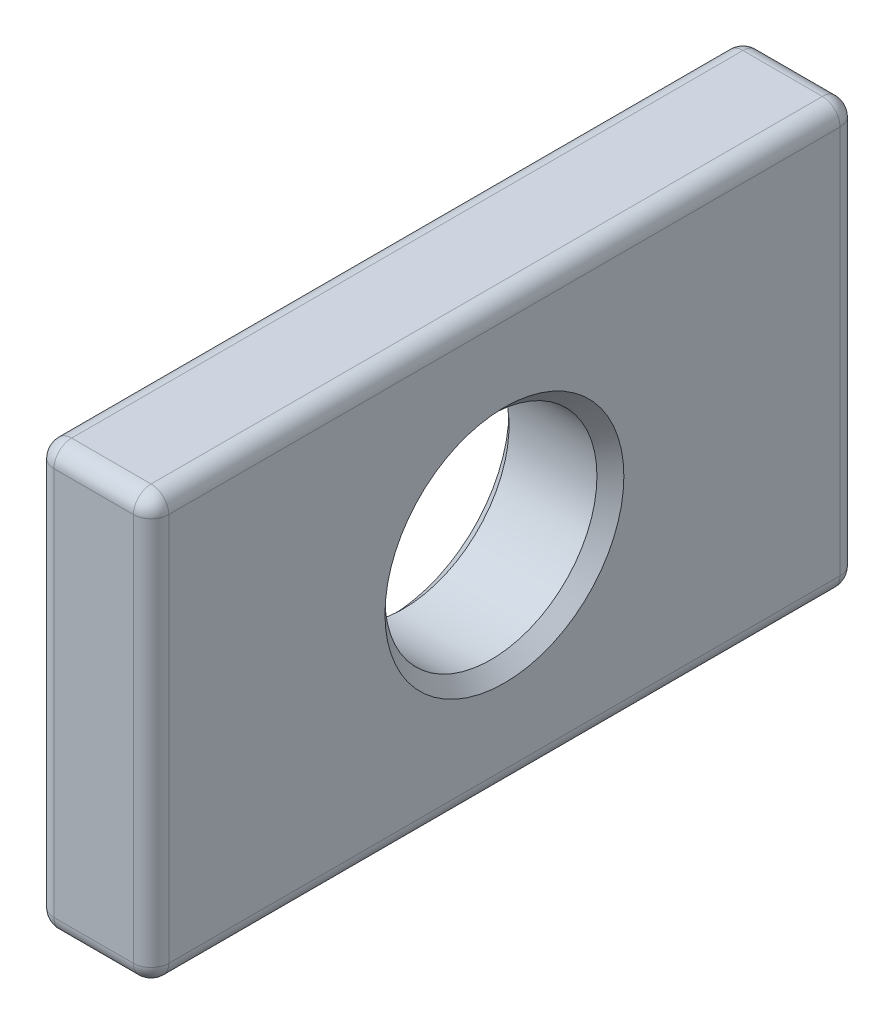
ISO-10303-21;
HEADER;
FILE_DESCRIPTION(('STEP AP214'),'2;1');
FILE_NAME('part.step','',(''),(''),'','','');
FILE_SCHEMA(('AUTOMOTIVE_DESIGN { 1 0 10303 214 1 1 1 1 }'));
ENDSEC;
DATA;
#1=APPLICATION_CONTEXT('core data for automotive mechanical design processes');
#2=APPLICATION_PROTOCOL_DEFINITION('international standard','automotive_design',2000,#1);
#3=PRODUCT_CONTEXT('',#1,'mechanical');
#4=PRODUCT('Part','Part','',(#3));
#5=PRODUCT_RELATED_PRODUCT_CATEGORY('part','',(#4));
#6=PRODUCT_DEFINITION_FORMATION('','',#4);
#7=PRODUCT_DEFINITION_CONTEXT('part definition',#1,'design');
#8=PRODUCT_DEFINITION('design','',#6,#7);
#9=PRODUCT_DEFINITION_SHAPE('','',#8);
#10=(LENGTH_UNIT() NAMED_UNIT(*) SI_UNIT(.MILLI.,.METRE.));
#11=(NAMED_UNIT(*) PLANE_ANGLE_UNIT() SI_UNIT($,.RADIAN.));
#12=(NAMED_UNIT(*) SI_UNIT($,.STERADIAN.) SOLID_ANGLE_UNIT());
#13=UNCERTAINTY_MEASURE_WITH_UNIT(LENGTH_MEASURE(1.E-05),#10,'distance_accuracy_value','');
#14=(GEOMETRIC_REPRESENTATION_CONTEXT(3) GLOBAL_UNCERTAINTY_ASSIGNED_CONTEXT((#13)) GLOBAL_UNIT_ASSIGNED_CONTEXT((#10,
#11,#12)) REPRESENTATION_CONTEXT('',''));
#15=CARTESIAN_POINT('',(0.,0.,0.));
#16=DIRECTION('',(0.,0.,1.));
#17=DIRECTION('',(1.,0.,0.));
#18=AXIS2_PLACEMENT_3D('',#15,#16,#17);
#19=CARTESIAN_POINT('',(3.25,0.,0.));
#20=DIRECTION('',(1.,0.,0.));
#21=DIRECTION('',(0.,0.,-1.));
#22=AXIS2_PLACEMENT_3D('',#19,#20,#21);
#23=PLANE('',#22);
#24=CARTESIAN_POINT('',(3.25,0.,0.));
#25=DIRECTION('',(1.,0.,0.));
#26=DIRECTION('',(0.,0.,-1.));
#27=AXIS2_PLACEMENT_3D('',#24,#25,#26);
#28=CIRCLE('',#27,6.76200000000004);
#29=CARTESIAN_POINT('',(3.25,0.,-6.76200000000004));
#30=VERTEX_POINT('',#29);
#31=EDGE_CURVE('E11',#30,#30,#28,.F.);
#32=ORIENTED_EDGE('',*,*,#31,.T.);
#33=EDGE_LOOP('',(#32));
#34=FACE_BOUND('',#33,.T.);
#35=DIRECTION('',(0.,0.,-1.));
#36=VECTOR('',#35,1.);
#37=CARTESIAN_POINT('',(3.25,-11.,-20.));
#38=LINE('',#37,#36);
#39=CARTESIAN_POINT('',(3.25,-11.,19.));
#40=VERTEX_POINT('',#39);
#41=CARTESIAN_POINT('',(3.25,-11.,-19.));
#42=VERTEX_POINT('',#41);
#43=EDGE_CURVE('E130',#40,#42,#38,.T.);
#44=ORIENTED_EDGE('',*,*,#43,.T.);
#45=DIRECTION('',(0.,1.,0.));
#46=VECTOR('',#45,1.);
#47=CARTESIAN_POINT('',(3.25,12.,-19.));
#48=LINE('',#47,#46);
#49=CARTESIAN_POINT('',(3.25,11.,-19.));
#50=VERTEX_POINT('',#49);
#51=EDGE_CURVE('E126',#42,#50,#48,.T.);
#52=ORIENTED_EDGE('',*,*,#51,.T.);
#53=DIRECTION('',(0.,0.,1.));
#54=VECTOR('',#53,1.);
#55=CARTESIAN_POINT('',(3.25,11.,20.));
#56=LINE('',#55,#54);
#57=CARTESIAN_POINT('',(3.25,11.,19.));
#58=VERTEX_POINT('',#57);
#59=EDGE_CURVE('E119',#50,#58,#56,.T.);
#60=ORIENTED_EDGE('',*,*,#59,.T.);
#61=DIRECTION('',(0.,-1.,0.));
#62=VECTOR('',#61,1.);
#63=CARTESIAN_POINT('',(3.25,-12.,19.));
#64=LINE('',#63,#62);
#65=EDGE_CURVE('E123',#58,#40,#64,.T.);
#66=ORIENTED_EDGE('',*,*,#65,.T.);
#67=EDGE_LOOP('',(#44,#52,#60,#66));
#68=FACE_BOUND('',#67,.T.);
#69=ADVANCED_FACE('F32',(#34,#68),#23,.T.);
#70=CARTESIAN_POINT('',(-3.25,0.,0.));
#71=DIRECTION('',(1.,0.,0.));
#72=DIRECTION('',(0.,0.,-1.));
#73=AXIS2_PLACEMENT_3D('',#70,#71,#72);
#74=PLANE('',#73);
#75=CARTESIAN_POINT('',(-3.25,0.,0.));
#76=DIRECTION('',(1.,0.,0.));
#77=DIRECTION('',(0.,0.,-1.));
#78=AXIS2_PLACEMENT_3D('',#75,#76,#77);
#79=CIRCLE('',#78,6.76199999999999);
#80=CARTESIAN_POINT('',(-3.25,0.,-6.76199999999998));
#81=VERTEX_POINT('',#80);
#82=EDGE_CURVE('E204',#81,#81,#79,.T.);
#83=ORIENTED_EDGE('',*,*,#82,.T.);
#84=EDGE_LOOP('',(#83));
#85=FACE_BOUND('',#84,.T.);
#86=DIRECTION('',(0.,0.,1.));
#87=VECTOR('',#86,1.);
#88=CARTESIAN_POINT('',(-3.25,11.,0.));
#89=LINE('',#88,#87);
#90=CARTESIAN_POINT('',(-3.25,11.,19.));
#91=VERTEX_POINT('',#90);
#92=CARTESIAN_POINT('',(-3.25,11.,-19.));
#93=VERTEX_POINT('',#92);
#94=EDGE_CURVE('E175',#91,#93,#89,.F.);
#95=ORIENTED_EDGE('',*,*,#94,.T.);
#96=DIRECTION('',(0.,1.,0.));
#97=VECTOR('',#96,1.);
#98=CARTESIAN_POINT('',(-3.25,0.,-19.));
#99=LINE('',#98,#97);
#100=CARTESIAN_POINT('',(-3.25,-11.,-19.));
#101=VERTEX_POINT('',#100);
#102=EDGE_CURVE('E180',#93,#101,#99,.F.);
#103=ORIENTED_EDGE('',*,*,#102,.T.);
#104=DIRECTION('',(0.,0.,-1.));
#105=VECTOR('',#104,1.);
#106=CARTESIAN_POINT('',(-3.25,-11.,0.));
#107=LINE('',#106,#105);
#108=CARTESIAN_POINT('',(-3.25,-11.,19.));
#109=VERTEX_POINT('',#108);
#110=EDGE_CURVE('E177',#101,#109,#107,.F.);
#111=ORIENTED_EDGE('',*,*,#110,.T.);
#112=DIRECTION('',(0.,-1.,0.));
#113=VECTOR('',#112,1.);
#114=CARTESIAN_POINT('',(-3.25,0.,19.));
#115=LINE('',#114,#113);
#116=EDGE_CURVE('E173',#109,#91,#115,.F.);
#117=ORIENTED_EDGE('',*,*,#116,.T.);
#118=EDGE_LOOP('',(#95,#103,#111,#117));
#119=FACE_BOUND('',#118,.T.);
#120=ADVANCED_FACE('F270',(#85,#119),#74,.F.);
#121=CARTESIAN_POINT('',(3.25,12.,-20.));
#122=DIRECTION('',(0.,0.,1.));
#123=DIRECTION('',(1.,0.,0.));
#124=AXIS2_PLACEMENT_3D('',#121,#122,#123);
#125=PLANE('',#124);
#126=DIRECTION('',(0.,1.,0.));
#127=VECTOR('',#126,1.);
#128=CARTESIAN_POINT('',(2.25,-12.,-20.));
#129=LINE('',#128,#127);
#130=CARTESIAN_POINT('',(2.25,11.,-20.));
#131=VERTEX_POINT('',#130);
#132=CARTESIAN_POINT('',(2.25,-11.,-20.));
#133=VERTEX_POINT('',#132);
#134=EDGE_CURVE('E193',#131,#133,#129,.F.);
#135=ORIENTED_EDGE('',*,*,#134,.T.);
#136=DIRECTION('',(-1.,0.,0.));
#137=VECTOR('',#136,1.);
#138=CARTESIAN_POINT('',(3.25,-11.,-20.));
#139=LINE('',#138,#137);
#140=CARTESIAN_POINT('',(-2.25,-11.,-20.));
#141=VERTEX_POINT('',#140);
#142=EDGE_CURVE('E195',#133,#141,#139,.T.);
#143=ORIENTED_EDGE('',*,*,#142,.T.);
#144=DIRECTION('',(0.,1.,0.));
#145=VECTOR('',#144,1.);
#146=CARTESIAN_POINT('',(-2.25,12.,-20.));
#147=LINE('',#146,#145);
#148=CARTESIAN_POINT('',(-2.25,11.,-20.));
#149=VERTEX_POINT('',#148);
#150=EDGE_CURVE('E189',#141,#149,#147,.T.);
#151=ORIENTED_EDGE('',*,*,#150,.T.);
#152=DIRECTION('',(-1.,0.,0.));
#153=VECTOR('',#152,1.);
#154=CARTESIAN_POINT('',(3.25,11.,-20.));
#155=LINE('',#154,#153);
#156=EDGE_CURVE('E191',#149,#131,#155,.F.);
#157=ORIENTED_EDGE('',*,*,#156,.T.);
#158=EDGE_LOOP('',(#135,#143,#151,#157));
#159=FACE_BOUND('',#158,.T.);
#160=ADVANCED_FACE('F273',(#159),#125,.F.);
#161=CARTESIAN_POINT('',(3.25,12.,20.));
#162=DIRECTION('',(0.,-1.,0.));
#163=DIRECTION('',(0.,0.,-1.));
#164=AXIS2_PLACEMENT_3D('',#161,#162,#163);
#165=PLANE('',#164);
#166=DIRECTION('',(0.,0.,1.));
#167=VECTOR('',#166,1.);
#168=CARTESIAN_POINT('',(2.25,12.,-20.));
#169=LINE('',#168,#167);
#170=CARTESIAN_POINT('',(2.25,12.,19.));
#171=VERTEX_POINT('',#170);
#172=CARTESIAN_POINT('',(2.25,12.,-19.));
#173=VERTEX_POINT('',#172);
#174=EDGE_CURVE('E138',#171,#173,#169,.F.);
#175=ORIENTED_EDGE('',*,*,#174,.T.);
#176=DIRECTION('',(-1.,0.,0.));
#177=VECTOR('',#176,1.);
#178=CARTESIAN_POINT('',(3.25,12.,-19.));
#179=LINE('',#178,#177);
#180=CARTESIAN_POINT('',(-2.25,12.,-19.));
#181=VERTEX_POINT('',#180);
#182=EDGE_CURVE('E187',#173,#181,#179,.T.);
#183=ORIENTED_EDGE('',*,*,#182,.T.);
#184=DIRECTION('',(0.,0.,1.));
#185=VECTOR('',#184,1.);
#186=CARTESIAN_POINT('',(-2.25,12.,20.));
#187=LINE('',#186,#185);
#188=CARTESIAN_POINT('',(-2.25,12.,19.));
#189=VERTEX_POINT('',#188);
#190=EDGE_CURVE('E184',#181,#189,#187,.T.);
#191=ORIENTED_EDGE('',*,*,#190,.T.);
#192=DIRECTION('',(-1.,0.,0.));
#193=VECTOR('',#192,1.);
#194=CARTESIAN_POINT('',(3.25,12.,19.));
#195=LINE('',#194,#193);
#196=EDGE_CURVE('E182',#189,#171,#195,.F.);
#197=ORIENTED_EDGE('',*,*,#196,.T.);
#198=EDGE_LOOP('',(#175,#183,#191,#197));
#199=FACE_BOUND('',#198,.T.);
#200=ADVANCED_FACE('F317',(#199),#165,.F.);
#201=CARTESIAN_POINT('',(3.25,12.,20.));
#202=DIRECTION('',(0.,0.,-1.));
#203=DIRECTION('',(-1.,0.,0.));
#204=AXIS2_PLACEMENT_3D('',#201,#202,#203);
#205=PLANE('',#204);
#206=DIRECTION('',(0.,-1.,0.));
#207=VECTOR('',#206,1.);
#208=CARTESIAN_POINT('',(2.25,12.,20.));
#209=LINE('',#208,#207);
#210=CARTESIAN_POINT('',(2.25,-11.,20.));
#211=VERTEX_POINT('',#210);
#212=CARTESIAN_POINT('',(2.25,11.,20.));
#213=VERTEX_POINT('',#212);
#214=EDGE_CURVE('E47',#211,#213,#209,.F.);
#215=ORIENTED_EDGE('',*,*,#214,.T.);
#216=DIRECTION('',(-1.,0.,0.));
#217=VECTOR('',#216,1.);
#218=CARTESIAN_POINT('',(3.25,11.,20.));
#219=LINE('',#218,#217);
#220=CARTESIAN_POINT('',(-2.25,11.,20.));
#221=VERTEX_POINT('',#220);
#222=EDGE_CURVE('E202',#213,#221,#219,.T.);
#223=ORIENTED_EDGE('',*,*,#222,.T.);
#224=DIRECTION('',(0.,-1.,0.));
#225=VECTOR('',#224,1.);
#226=CARTESIAN_POINT('',(-2.25,12.,20.));
#227=LINE('',#226,#225);
#228=CARTESIAN_POINT('',(-2.25,-11.,20.));
#229=VERTEX_POINT('',#228);
#230=EDGE_CURVE('E198',#221,#229,#227,.T.);
#231=ORIENTED_EDGE('',*,*,#230,.T.);
#232=DIRECTION('',(-1.,0.,0.));
#233=VECTOR('',#232,1.);
#234=CARTESIAN_POINT('',(3.25,-11.,20.));
#235=LINE('',#234,#233);
#236=EDGE_CURVE('E52',#229,#211,#235,.F.);
#237=ORIENTED_EDGE('',*,*,#236,.T.);
#238=EDGE_LOOP('',(#215,#223,#231,#237));
#239=FACE_BOUND('',#238,.T.);
#240=ADVANCED_FACE('F314',(#239),#205,.F.);
#241=CARTESIAN_POINT('',(3.25,-12.,20.));
#242=DIRECTION('',(0.,1.,0.));
#243=DIRECTION('',(0.,0.,1.));
#244=AXIS2_PLACEMENT_3D('',#241,#242,#243);
#245=PLANE('',#244);
#246=DIRECTION('',(0.,0.,-1.));
#247=VECTOR('',#246,1.);
#248=CARTESIAN_POINT('',(-2.25,-12.,20.));
#249=LINE('',#248,#247);
#250=CARTESIAN_POINT('',(-2.25,-12.,19.));
#251=VERTEX_POINT('',#250);
#252=CARTESIAN_POINT('',(-2.25,-12.,-19.));
#253=VERTEX_POINT('',#252);
#254=EDGE_CURVE('E166',#251,#253,#249,.T.);
#255=ORIENTED_EDGE('',*,*,#254,.T.);
#256=DIRECTION('',(-1.,0.,0.));
#257=VECTOR('',#256,1.);
#258=CARTESIAN_POINT('',(3.25,-12.,-19.));
#259=LINE('',#258,#257);
#260=CARTESIAN_POINT('',(2.25,-12.,-19.));
#261=VERTEX_POINT('',#260);
#262=EDGE_CURVE('E171',#253,#261,#259,.F.);
#263=ORIENTED_EDGE('',*,*,#262,.T.);
#264=DIRECTION('',(0.,0.,-1.));
#265=VECTOR('',#264,1.);
#266=CARTESIAN_POINT('',(2.25,-12.,20.));
#267=LINE('',#266,#265);
#268=CARTESIAN_POINT('',(2.25,-12.,19.));
#269=VERTEX_POINT('',#268);
#270=EDGE_CURVE('E168',#261,#269,#267,.F.);
#271=ORIENTED_EDGE('',*,*,#270,.T.);
#272=DIRECTION('',(-1.,0.,0.));
#273=VECTOR('',#272,1.);
#274=CARTESIAN_POINT('',(3.25,-12.,19.));
#275=LINE('',#274,#273);
#276=EDGE_CURVE('E164',#269,#251,#275,.T.);
#277=ORIENTED_EDGE('',*,*,#276,.T.);
#278=EDGE_LOOP('',(#255,#263,#271,#277));
#279=FACE_BOUND('',#278,.T.);
#280=ADVANCED_FACE('F316',(#279),#245,.F.);
#281=CARTESIAN_POINT('',(3.25,0.,0.));
#282=DIRECTION('',(-1.,0.,0.));
#283=DIRECTION('',(0.,0.,1.));
#284=AXIS2_PLACEMENT_3D('',#281,#282,#283);
#285=CYLINDRICAL_SURFACE('',#284,6.);
#286=CARTESIAN_POINT('',(-2.48800000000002,0.,0.));
#287=DIRECTION('',(1.,0.,0.));
#288=DIRECTION('',(0.,0.,-1.));
#289=AXIS2_PLACEMENT_3D('',#286,#287,#288);
#290=CIRCLE('',#289,6.);
#291=CARTESIAN_POINT('',(-2.48800000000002,0.,6.00000000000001));
#292=VERTEX_POINT('',#291);
#293=EDGE_CURVE('E40',#292,#292,#290,.F.);
#294=CARTESIAN_POINT('',(2.48799999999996,0.,0.));
#295=DIRECTION('',(1.,0.,0.));
#296=DIRECTION('',(0.,0.,-1.));
#297=AXIS2_PLACEMENT_3D('',#294,#295,#296);
#298=CIRCLE('',#297,6.);
#299=CARTESIAN_POINT('',(2.48799999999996,0.,6.00000000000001));
#300=VERTEX_POINT('',#299);
#301=EDGE_CURVE('E256',#300,#300,#298,.T.);
#302=CARTESIAN_POINT('',(-2.48800000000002,0.,6.00000000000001));
#303=CARTESIAN_POINT('',(-2.43616666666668,0.,6.00000000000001));
#304=CARTESIAN_POINT('',(-2.38433333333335,0.,6.00000000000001));
#305=CARTESIAN_POINT('',(-2.28066666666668,0.,6.00000000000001));
#306=CARTESIAN_POINT('',(-2.22883333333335,0.,6.00000000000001));
#307=CARTESIAN_POINT('',(-2.12516666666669,0.,6.00000000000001));
#308=CARTESIAN_POINT('',(-2.07333333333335,0.,6.00000000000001));
#309=CARTESIAN_POINT('',(-1.96966666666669,0.,6.00000000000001));
#310=CARTESIAN_POINT('',(-1.91783333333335,0.,6.00000000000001));
#311=CARTESIAN_POINT('',(-1.81416666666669,0.,6.00000000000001));
#312=CARTESIAN_POINT('',(-1.76233333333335,0.,6.00000000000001));
#313=CARTESIAN_POINT('',(-1.65866666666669,0.,6.00000000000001));
#314=CARTESIAN_POINT('',(-1.60683333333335,0.,6.00000000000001));
#315=CARTESIAN_POINT('',(-1.50316666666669,0.,6.00000000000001));
#316=CARTESIAN_POINT('',(-1.45133333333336,0.,6.00000000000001));
#317=CARTESIAN_POINT('',(-1.34766666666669,0.,6.00000000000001));
#318=CARTESIAN_POINT('',(-1.29583333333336,0.,6.00000000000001));
#319=CARTESIAN_POINT('',(-1.19216666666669,0.,6.00000000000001));
#320=CARTESIAN_POINT('',(-1.14033333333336,0.,6.00000000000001));
#321=CARTESIAN_POINT('',(-1.03666666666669,0.,6.00000000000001));
#322=CARTESIAN_POINT('',(-0.984833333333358,0.,6.00000000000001));
#323=CARTESIAN_POINT('',(-0.881166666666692,0.,6.00000000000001));
#324=CARTESIAN_POINT('',(-0.829333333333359,0.,6.00000000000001));
#325=CARTESIAN_POINT('',(-0.725666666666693,0.,6.00000000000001));
#326=CARTESIAN_POINT('',(-0.67383333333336,0.,6.00000000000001));
#327=CARTESIAN_POINT('',(-0.570166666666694,0.,6.00000000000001));
#328=CARTESIAN_POINT('',(-0.518333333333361,0.,6.00000000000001));
#329=CARTESIAN_POINT('',(-0.414666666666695,0.,6.00000000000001));
#330=CARTESIAN_POINT('',(-0.362833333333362,0.,6.00000000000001));
#331=CARTESIAN_POINT('',(-0.259166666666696,0.,6.00000000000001));
#332=CARTESIAN_POINT('',(-0.207333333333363,0.,6.00000000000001));
#333=CARTESIAN_POINT('',(-0.103666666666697,0.,6.00000000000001));
#334=CARTESIAN_POINT('',(-0.0518333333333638,0.,6.00000000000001));
#335=CARTESIAN_POINT('',(0.0518333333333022,0.,6.00000000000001));
#336=CARTESIAN_POINT('',(0.103666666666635,0.,6.00000000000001));
#337=CARTESIAN_POINT('',(0.207333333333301,0.,6.00000000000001));
#338=CARTESIAN_POINT('',(0.259166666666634,0.,6.00000000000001));
#339=CARTESIAN_POINT('',(0.362833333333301,0.,6.00000000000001));
#340=CARTESIAN_POINT('',(0.414666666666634,0.,6.00000000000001));
#341=CARTESIAN_POINT('',(0.5183333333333,0.,6.00000000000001));
#342=CARTESIAN_POINT('',(0.570166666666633,0.,6.00000000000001));
#343=CARTESIAN_POINT('',(0.673833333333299,0.,6.00000000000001));
#344=CARTESIAN_POINT('',(0.725666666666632,0.,6.00000000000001));
#345=CARTESIAN_POINT('',(0.829333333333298,0.,6.00000000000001));
#346=CARTESIAN_POINT('',(0.881166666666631,0.,6.00000000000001));
#347=CARTESIAN_POINT('',(0.984833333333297,0.,6.00000000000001));
#348=CARTESIAN_POINT('',(1.03666666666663,0.,6.00000000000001));
#349=CARTESIAN_POINT('',(1.1403333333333,0.,6.00000000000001));
#350=CARTESIAN_POINT('',(1.19216666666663,0.,6.00000000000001));
#351=CARTESIAN_POINT('',(1.2958333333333,0.,6.00000000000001));
#352=CARTESIAN_POINT('',(1.34766666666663,0.,6.00000000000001));
#353=CARTESIAN_POINT('',(1.45133333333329,0.,6.00000000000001));
#354=CARTESIAN_POINT('',(1.50316666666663,0.,6.00000000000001));
#355=CARTESIAN_POINT('',(1.60683333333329,0.,6.00000000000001));
#356=CARTESIAN_POINT('',(1.65866666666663,0.,6.00000000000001));
#357=CARTESIAN_POINT('',(1.76233333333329,0.,6.00000000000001));
#358=CARTESIAN_POINT('',(1.81416666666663,0.,6.00000000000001));
#359=CARTESIAN_POINT('',(1.91783333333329,0.,6.00000000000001));
#360=CARTESIAN_POINT('',(1.96966666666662,0.,6.00000000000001));
#361=CARTESIAN_POINT('',(2.07333333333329,0.,6.00000000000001));
#362=CARTESIAN_POINT('',(2.12516666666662,0.,6.00000000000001));
#363=CARTESIAN_POINT('',(2.22883333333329,0.,6.00000000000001));
#364=CARTESIAN_POINT('',(2.28066666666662,0.,6.00000000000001));
#365=CARTESIAN_POINT('',(2.38433333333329,0.,6.00000000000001));
#366=CARTESIAN_POINT('',(2.43616666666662,0.,6.00000000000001));
#367=CARTESIAN_POINT('',(2.48799999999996,0.,6.00000000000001));
#368=B_SPLINE_CURVE_WITH_KNOTS('',3,(#302,#303,#304,#305,#306,#307,#308,#309,#310,#311,#312,
#313,#314,#315,#316,#317,#318,#319,#320,#321,#322,#323,#324,#325,#326,#327,#328,#329,#330,#331,
#332,#333,#334,#335,#336,#337,#338,#339,#340,#341,#342,#343,#344,#345,#346,#347,#348,#349,#350,
#351,#352,#353,#354,#355,#356,#357,#358,#359,#360,#361,#362,#363,#364,#365,#366,#367),
.UNSPECIFIED.,.F.,.F.,(4,2,2,2,2,2,2,2,2,2,2,2,2,2,2,2,2,2,2,2,2,2,2,2,2,2,2,2,2,2,2,2,4),(0.,
0.155499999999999,0.310999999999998,0.466499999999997,0.621999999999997,0.777499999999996,
0.932999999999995,1.08849999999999,1.24399999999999,1.39949999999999,1.55499999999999,
1.71049999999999,1.86599999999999,2.02149999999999,2.17699999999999,2.33249999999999,
2.48799999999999,2.64349999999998,2.79899999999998,2.95449999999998,3.10999999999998,
3.26549999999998,3.42099999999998,3.57649999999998,3.73199999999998,3.88749999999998,
4.04299999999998,4.19849999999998,4.35399999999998,4.50949999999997,4.66499999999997,
4.82049999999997,4.97599999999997),.UNSPECIFIED.);
#369=EDGE_CURVE('BSEAM261',#292,#300,#368,.T.);
#370=ORIENTED_EDGE('',*,*,#293,.T.);
#371=ORIENTED_EDGE('',*,*,#301,.T.);
#372=ORIENTED_EDGE('',*,*,#369,.T.);
#373=ORIENTED_EDGE('',*,*,#369,.F.);
#374=EDGE_LOOP('',(#370,#372,#371,#373));
#375=FACE_BOUND('',#374,.T.);
#376=ADVANCED_FACE('F261',(#375),#285,.F.);
#377=CARTESIAN_POINT('',(-2.25,11.,20.));
#378=DIRECTION('',(0.,0.,1.));
#379=DIRECTION('',(1.,0.,0.));
#380=AXIS2_PLACEMENT_3D('',#377,#378,#379);
#381=CYLINDRICAL_SURFACE('',#380,1.);
#382=CARTESIAN_POINT('',(-2.25,11.,19.));
#383=DIRECTION('',(0.,0.,1.));
#384=DIRECTION('',(1.,0.,0.));
#385=AXIS2_PLACEMENT_3D('',#382,#383,#384);
#386=CIRCLE('',#385,1.);
#387=EDGE_CURVE('E156',#189,#91,#386,.T.);
#388=ORIENTED_EDGE('',*,*,#387,.F.);
#389=ORIENTED_EDGE('',*,*,#190,.F.);
#390=CARTESIAN_POINT('',(-2.25,11.,-19.));
#391=DIRECTION('',(0.,0.,-1.));
#392=DIRECTION('',(0.,1.,0.));
#393=AXIS2_PLACEMENT_3D('',#390,#391,#392);
#394=CIRCLE('',#393,1.);
#395=EDGE_CURVE('E159',#93,#181,#394,.T.);
#396=ORIENTED_EDGE('',*,*,#395,.F.);
#397=ORIENTED_EDGE('',*,*,#94,.F.);
#398=EDGE_LOOP('',(#388,#389,#396,#397));
#399=FACE_BOUND('',#398,.T.);
#400=ADVANCED_FACE('F284',(#399),#381,.T.);
#401=CARTESIAN_POINT('',(-2.25,11.,19.));
#402=DIRECTION('',(0.,0.,1.));
#403=DIRECTION('',(1.,0.,0.));
#404=AXIS2_PLACEMENT_3D('',#401,#402,#403);
#405=SPHERICAL_SURFACE('',#404,1.);
#406=CARTESIAN_POINT('',(-2.25,11.,19.));
#407=DIRECTION('',(-1.,0.,0.));
#408=DIRECTION('',(0.,0.,1.));
#409=AXIS2_PLACEMENT_3D('',#406,#407,#408);
#410=CIRCLE('',#409,1.);
#411=EDGE_CURVE('E246',#189,#221,#410,.F.);
#412=ORIENTED_EDGE('',*,*,#411,.F.);
#413=ORIENTED_EDGE('',*,*,#387,.T.);
#414=CARTESIAN_POINT('',(-2.25,11.,19.));
#415=DIRECTION('',(0.,1.,0.));
#416=DIRECTION('',(0.,0.,1.));
#417=AXIS2_PLACEMENT_3D('',#414,#415,#416);
#418=CIRCLE('',#417,1.);
#419=EDGE_CURVE('E249',#221,#91,#418,.F.);
#420=ORIENTED_EDGE('',*,*,#419,.F.);
#421=EDGE_LOOP('',(#412,#413,#420));
#422=FACE_BOUND('',#421,.T.);
#423=ADVANCED_FACE('F310',(#422),#405,.T.);
#424=CARTESIAN_POINT('',(-2.25,11.,-19.));
#425=DIRECTION('',(0.,0.,1.));
#426=DIRECTION('',(1.,0.,0.));
#427=AXIS2_PLACEMENT_3D('',#424,#425,#426);
#428=SPHERICAL_SURFACE('',#427,1.);
#429=CARTESIAN_POINT('',(-2.25,11.,-19.));
#430=DIRECTION('',(0.,1.,0.));
#431=DIRECTION('',(0.,0.,1.));
#432=AXIS2_PLACEMENT_3D('',#429,#430,#431);
#433=CIRCLE('',#432,1.);
#434=EDGE_CURVE('E240',#93,#149,#433,.F.);
#435=ORIENTED_EDGE('',*,*,#434,.F.);
#436=ORIENTED_EDGE('',*,*,#395,.T.);
#437=CARTESIAN_POINT('',(-2.25,11.,-19.));
#438=DIRECTION('',(-1.,0.,0.));
#439=DIRECTION('',(0.,0.,1.));
#440=AXIS2_PLACEMENT_3D('',#437,#438,#439);
#441=CIRCLE('',#440,1.);
#442=EDGE_CURVE('E243',#149,#181,#441,.F.);
#443=ORIENTED_EDGE('',*,*,#442,.F.);
#444=EDGE_LOOP('',(#435,#436,#443));
#445=FACE_BOUND('',#444,.T.);
#446=ADVANCED_FACE('F287',(#445),#428,.T.);
#447=CARTESIAN_POINT('',(-2.25,12.,19.));
#448=DIRECTION('',(0.,-1.,0.));
#449=DIRECTION('',(0.,0.,-1.));
#450=AXIS2_PLACEMENT_3D('',#447,#448,#449);
#451=CYLINDRICAL_SURFACE('',#450,1.);
#452=ORIENTED_EDGE('',*,*,#419,.T.);
#453=ORIENTED_EDGE('',*,*,#116,.F.);
#454=CARTESIAN_POINT('',(-2.25,-11.,19.));
#455=DIRECTION('',(0.,-1.,0.));
#456=DIRECTION('',(0.,0.,-1.));
#457=AXIS2_PLACEMENT_3D('',#454,#455,#456);
#458=CIRCLE('',#457,1.);
#459=EDGE_CURVE('E235',#229,#109,#458,.T.);
#460=ORIENTED_EDGE('',*,*,#459,.F.);
#461=ORIENTED_EDGE('',*,*,#230,.F.);
#462=EDGE_LOOP('',(#452,#453,#460,#461));
#463=FACE_BOUND('',#462,.T.);
#464=ADVANCED_FACE('F306',(#463),#451,.T.);
#465=CARTESIAN_POINT('',(3.25,11.,19.));
#466=DIRECTION('',(-1.,0.,0.));
#467=DIRECTION('',(0.,0.,1.));
#468=AXIS2_PLACEMENT_3D('',#465,#466,#467);
#469=CYLINDRICAL_SURFACE('',#468,1.);
#470=ORIENTED_EDGE('',*,*,#411,.T.);
#471=ORIENTED_EDGE('',*,*,#222,.F.);
#472=CARTESIAN_POINT('',(2.25,11.,19.));
#473=DIRECTION('',(1.,0.,0.));
#474=DIRECTION('',(0.,0.,-1.));
#475=AXIS2_PLACEMENT_3D('',#472,#473,#474);
#476=CIRCLE('',#475,1.);
#477=EDGE_CURVE('E142',#171,#213,#476,.T.);
#478=ORIENTED_EDGE('',*,*,#477,.F.);
#479=ORIENTED_EDGE('',*,*,#196,.F.);
#480=EDGE_LOOP('',(#470,#471,#478,#479));
#481=FACE_BOUND('',#480,.T.);
#482=ADVANCED_FACE('F313',(#481),#469,.T.);
#483=CARTESIAN_POINT('',(2.25,11.,0.));
#484=DIRECTION('',(0.,0.,-1.));
#485=DIRECTION('',(-1.,0.,0.));
#486=AXIS2_PLACEMENT_3D('',#483,#484,#485);
#487=CYLINDRICAL_SURFACE('',#486,1.);
#488=CARTESIAN_POINT('',(2.25,11.,-19.));
#489=DIRECTION('',(0.,0.,-1.));
#490=DIRECTION('',(-1.,0.,0.));
#491=AXIS2_PLACEMENT_3D('',#488,#489,#490);
#492=CIRCLE('',#491,1.);
#493=EDGE_CURVE('E143',#173,#50,#492,.T.);
#494=ORIENTED_EDGE('',*,*,#493,.F.);
#495=ORIENTED_EDGE('',*,*,#174,.F.);
#496=CARTESIAN_POINT('',(2.25,11.,19.));
#497=DIRECTION('',(0.,0.,1.));
#498=DIRECTION('',(1.,0.,0.));
#499=AXIS2_PLACEMENT_3D('',#496,#497,#498);
#500=CIRCLE('',#499,1.);
#501=EDGE_CURVE('E134',#58,#171,#500,.T.);
#502=ORIENTED_EDGE('',*,*,#501,.F.);
#503=ORIENTED_EDGE('',*,*,#59,.F.);
#504=EDGE_LOOP('',(#494,#495,#502,#503));
#505=FACE_BOUND('',#504,.T.);
#506=ADVANCED_FACE('F136',(#505),#487,.T.);
#507=CARTESIAN_POINT('',(3.25,11.,-19.));
#508=DIRECTION('',(-1.,0.,0.));
#509=DIRECTION('',(0.,0.,1.));
#510=AXIS2_PLACEMENT_3D('',#507,#508,#509);
#511=CYLINDRICAL_SURFACE('',#510,1.);
#512=ORIENTED_EDGE('',*,*,#442,.T.);
#513=ORIENTED_EDGE('',*,*,#182,.F.);
#514=CARTESIAN_POINT('',(2.25,11.,-19.));
#515=DIRECTION('',(1.,0.,0.));
#516=DIRECTION('',(0.,0.,-1.));
#517=AXIS2_PLACEMENT_3D('',#514,#515,#516);
#518=CIRCLE('',#517,1.);
#519=EDGE_CURVE('E231',#131,#173,#518,.T.);
#520=ORIENTED_EDGE('',*,*,#519,.F.);
#521=ORIENTED_EDGE('',*,*,#156,.F.);
#522=EDGE_LOOP('',(#512,#513,#520,#521));
#523=FACE_BOUND('',#522,.T.);
#524=ADVANCED_FACE('F351',(#523),#511,.T.);
#525=CARTESIAN_POINT('',(-2.25,12.,-19.));
#526=DIRECTION('',(0.,1.,0.));
#527=DIRECTION('',(0.,0.,1.));
#528=AXIS2_PLACEMENT_3D('',#525,#526,#527);
#529=CYLINDRICAL_SURFACE('',#528,1.);
#530=ORIENTED_EDGE('',*,*,#434,.T.);
#531=ORIENTED_EDGE('',*,*,#150,.F.);
#532=CARTESIAN_POINT('',(-2.25,-11.,-19.));
#533=DIRECTION('',(0.,-1.,0.));
#534=DIRECTION('',(0.,0.,-1.));
#535=AXIS2_PLACEMENT_3D('',#532,#533,#534);
#536=CIRCLE('',#535,1.);
#537=EDGE_CURVE('E228',#101,#141,#536,.T.);
#538=ORIENTED_EDGE('',*,*,#537,.F.);
#539=ORIENTED_EDGE('',*,*,#102,.F.);
#540=EDGE_LOOP('',(#530,#531,#538,#539));
#541=FACE_BOUND('',#540,.T.);
#542=ADVANCED_FACE('F292',(#541),#529,.T.);
#543=CARTESIAN_POINT('',(-2.25,-11.,20.));
#544=DIRECTION('',(0.,0.,-1.));
#545=DIRECTION('',(-1.,0.,0.));
#546=AXIS2_PLACEMENT_3D('',#543,#544,#545);
#547=CYLINDRICAL_SURFACE('',#546,1.);
#548=CARTESIAN_POINT('',(-2.25,-11.,19.));
#549=DIRECTION('',(0.,0.,1.));
#550=DIRECTION('',(1.,0.,0.));
#551=AXIS2_PLACEMENT_3D('',#548,#549,#550);
#552=CIRCLE('',#551,1.);
#553=EDGE_CURVE('E237',#109,#251,#552,.T.);
#554=ORIENTED_EDGE('',*,*,#553,.F.);
#555=ORIENTED_EDGE('',*,*,#110,.F.);
#556=CARTESIAN_POINT('',(-2.25,-11.,-19.));
#557=DIRECTION('',(0.,0.,-1.));
#558=DIRECTION('',(-1.,0.,0.));
#559=AXIS2_PLACEMENT_3D('',#556,#557,#558);
#560=CIRCLE('',#559,1.);
#561=EDGE_CURVE('E225',#253,#101,#560,.T.);
#562=ORIENTED_EDGE('',*,*,#561,.F.);
#563=ORIENTED_EDGE('',*,*,#254,.F.);
#564=EDGE_LOOP('',(#554,#555,#562,#563));
#565=FACE_BOUND('',#564,.T.);
#566=ADVANCED_FACE('F301',(#565),#547,.T.);
#567=CARTESIAN_POINT('',(-2.25,-11.,19.));
#568=DIRECTION('',(0.,0.,1.));
#569=DIRECTION('',(1.,0.,0.));
#570=AXIS2_PLACEMENT_3D('',#567,#568,#569);
#571=SPHERICAL_SURFACE('',#570,1.);
#572=ORIENTED_EDGE('',*,*,#459,.T.);
#573=ORIENTED_EDGE('',*,*,#553,.T.);
#574=CARTESIAN_POINT('',(-2.25,-11.,19.));
#575=DIRECTION('',(-1.,0.,0.));
#576=DIRECTION('',(0.,0.,1.));
#577=AXIS2_PLACEMENT_3D('',#574,#575,#576);
#578=CIRCLE('',#577,1.);
#579=EDGE_CURVE('E149',#229,#251,#578,.F.);
#580=ORIENTED_EDGE('',*,*,#579,.F.);
#581=EDGE_LOOP('',(#572,#573,#580));
#582=FACE_BOUND('',#581,.T.);
#583=ADVANCED_FACE('F359',(#582),#571,.T.);
#584=CARTESIAN_POINT('',(2.25,11.,19.));
#585=DIRECTION('',(0.,0.,1.));
#586=DIRECTION('',(1.,0.,0.));
#587=AXIS2_PLACEMENT_3D('',#584,#585,#586);
#588=SPHERICAL_SURFACE('',#587,1.);
#589=ORIENTED_EDGE('',*,*,#501,.T.);
#590=ORIENTED_EDGE('',*,*,#477,.T.);
#591=CARTESIAN_POINT('',(2.25,11.,19.));
#592=DIRECTION('',(0.,1.,0.));
#593=DIRECTION('',(0.,0.,1.));
#594=AXIS2_PLACEMENT_3D('',#591,#592,#593);
#595=CIRCLE('',#594,1.);
#596=EDGE_CURVE('E146',#58,#213,#595,.F.);
#597=ORIENTED_EDGE('',*,*,#596,.F.);
#598=EDGE_LOOP('',(#589,#590,#597));
#599=FACE_BOUND('',#598,.T.);
#600=ADVANCED_FACE('F147',(#599),#588,.T.);
#601=CARTESIAN_POINT('',(2.25,11.,-19.));
#602=DIRECTION('',(0.,0.,1.));
#603=DIRECTION('',(1.,0.,0.));
#604=AXIS2_PLACEMENT_3D('',#601,#602,#603);
#605=SPHERICAL_SURFACE('',#604,1.);
#606=ORIENTED_EDGE('',*,*,#519,.T.);
#607=ORIENTED_EDGE('',*,*,#493,.T.);
#608=CARTESIAN_POINT('',(2.25,11.,-19.));
#609=DIRECTION('',(0.,1.,0.));
#610=DIRECTION('',(0.,0.,1.));
#611=AXIS2_PLACEMENT_3D('',#608,#609,#610);
#612=CIRCLE('',#611,1.);
#613=EDGE_CURVE('E150',#131,#50,#612,.F.);
#614=ORIENTED_EDGE('',*,*,#613,.F.);
#615=EDGE_LOOP('',(#606,#607,#614));
#616=FACE_BOUND('',#615,.T.);
#617=ADVANCED_FACE('F364',(#616),#605,.T.);
#618=CARTESIAN_POINT('',(-2.25,-11.,-19.));
#619=DIRECTION('',(0.,0.,1.));
#620=DIRECTION('',(1.,0.,0.));
#621=AXIS2_PLACEMENT_3D('',#618,#619,#620);
#622=SPHERICAL_SURFACE('',#621,1.);
#623=ORIENTED_EDGE('',*,*,#561,.T.);
#624=ORIENTED_EDGE('',*,*,#537,.T.);
#625=CARTESIAN_POINT('',(-2.25,-11.,-19.));
#626=DIRECTION('',(-1.,0.,0.));
#627=DIRECTION('',(0.,0.,1.));
#628=AXIS2_PLACEMENT_3D('',#625,#626,#627);
#629=CIRCLE('',#628,1.);
#630=EDGE_CURVE('E219',#253,#141,#629,.F.);
#631=ORIENTED_EDGE('',*,*,#630,.F.);
#632=EDGE_LOOP('',(#623,#624,#631));
#633=FACE_BOUND('',#632,.T.);
#634=ADVANCED_FACE('F296',(#633),#622,.T.);
#635=CARTESIAN_POINT('',(3.25,-11.,19.));
#636=DIRECTION('',(-1.,0.,0.));
#637=DIRECTION('',(0.,0.,1.));
#638=AXIS2_PLACEMENT_3D('',#635,#636,#637);
#639=CYLINDRICAL_SURFACE('',#638,1.);
#640=ORIENTED_EDGE('',*,*,#579,.T.);
#641=ORIENTED_EDGE('',*,*,#276,.F.);
#642=CARTESIAN_POINT('',(2.25,-11.,19.));
#643=DIRECTION('',(1.,0.,0.));
#644=DIRECTION('',(0.,0.,-1.));
#645=AXIS2_PLACEMENT_3D('',#642,#643,#644);
#646=CIRCLE('',#645,1.);
#647=EDGE_CURVE('E216',#211,#269,#646,.T.);
#648=ORIENTED_EDGE('',*,*,#647,.F.);
#649=ORIENTED_EDGE('',*,*,#236,.F.);
#650=EDGE_LOOP('',(#640,#641,#648,#649));
#651=FACE_BOUND('',#650,.T.);
#652=ADVANCED_FACE('F370',(#651),#639,.T.);
#653=CARTESIAN_POINT('',(2.25,0.,19.));
#654=DIRECTION('',(0.,1.,0.));
#655=DIRECTION('',(0.,0.,1.));
#656=AXIS2_PLACEMENT_3D('',#653,#654,#655);
#657=CYLINDRICAL_SURFACE('',#656,1.);
#658=ORIENTED_EDGE('',*,*,#596,.T.);
#659=ORIENTED_EDGE('',*,*,#214,.F.);
#660=CARTESIAN_POINT('',(2.25,-11.,19.));
#661=DIRECTION('',(0.,-1.,0.));
#662=DIRECTION('',(0.,0.,-1.));
#663=AXIS2_PLACEMENT_3D('',#660,#661,#662);
#664=CIRCLE('',#663,1.);
#665=EDGE_CURVE('E154',#40,#211,#664,.T.);
#666=ORIENTED_EDGE('',*,*,#665,.F.);
#667=ORIENTED_EDGE('',*,*,#65,.F.);
#668=EDGE_LOOP('',(#658,#659,#666,#667));
#669=FACE_BOUND('',#668,.T.);
#670=ADVANCED_FACE('F152',(#669),#657,.T.);
#671=CARTESIAN_POINT('',(2.25,0.,-19.));
#672=DIRECTION('',(0.,-1.,0.));
#673=DIRECTION('',(0.,0.,-1.));
#674=AXIS2_PLACEMENT_3D('',#671,#672,#673);
#675=CYLINDRICAL_SURFACE('',#674,1.);
#676=ORIENTED_EDGE('',*,*,#613,.T.);
#677=ORIENTED_EDGE('',*,*,#51,.F.);
#678=CARTESIAN_POINT('',(2.25,-11.,-19.));
#679=DIRECTION('',(0.,-1.,0.));
#680=DIRECTION('',(1.,0.,0.));
#681=AXIS2_PLACEMENT_3D('',#678,#679,#680);
#682=CIRCLE('',#681,1.);
#683=EDGE_CURVE('E212',#133,#42,#682,.T.);
#684=ORIENTED_EDGE('',*,*,#683,.F.);
#685=ORIENTED_EDGE('',*,*,#134,.F.);
#686=EDGE_LOOP('',(#676,#677,#684,#685));
#687=FACE_BOUND('',#686,.T.);
#688=ADVANCED_FACE('F376',(#687),#675,.T.);
#689=CARTESIAN_POINT('',(3.25,-11.,-19.));
#690=DIRECTION('',(-1.,0.,0.));
#691=DIRECTION('',(0.,0.,1.));
#692=AXIS2_PLACEMENT_3D('',#689,#690,#691);
#693=CYLINDRICAL_SURFACE('',#692,1.);
#694=ORIENTED_EDGE('',*,*,#630,.T.);
#695=ORIENTED_EDGE('',*,*,#142,.F.);
#696=CARTESIAN_POINT('',(2.25,-11.,-19.));
#697=DIRECTION('',(1.,0.,0.));
#698=DIRECTION('',(0.,0.,-1.));
#699=AXIS2_PLACEMENT_3D('',#696,#697,#698);
#700=CIRCLE('',#699,1.);
#701=EDGE_CURVE('E209',#261,#133,#700,.T.);
#702=ORIENTED_EDGE('',*,*,#701,.F.);
#703=ORIENTED_EDGE('',*,*,#262,.F.);
#704=EDGE_LOOP('',(#694,#695,#702,#703));
#705=FACE_BOUND('',#704,.T.);
#706=ADVANCED_FACE('F379',(#705),#693,.T.);
#707=CARTESIAN_POINT('',(2.25,-11.,19.));
#708=DIRECTION('',(0.,0.,1.));
#709=DIRECTION('',(1.,0.,0.));
#710=AXIS2_PLACEMENT_3D('',#707,#708,#709);
#711=SPHERICAL_SURFACE('',#710,1.);
#712=ORIENTED_EDGE('',*,*,#665,.T.);
#713=ORIENTED_EDGE('',*,*,#647,.T.);
#714=CARTESIAN_POINT('',(2.25,-11.,19.));
#715=DIRECTION('',(0.,0.,1.));
#716=DIRECTION('',(1.,0.,0.));
#717=AXIS2_PLACEMENT_3D('',#714,#715,#716);
#718=CIRCLE('',#717,1.);
#719=EDGE_CURVE('E207',#40,#269,#718,.F.);
#720=ORIENTED_EDGE('',*,*,#719,.F.);
#721=EDGE_LOOP('',(#712,#713,#720));
#722=FACE_BOUND('',#721,.T.);
#723=ADVANCED_FACE('F383',(#722),#711,.T.);
#724=CARTESIAN_POINT('',(2.25,-11.,-19.));
#725=DIRECTION('',(0.,0.,1.));
#726=DIRECTION('',(1.,0.,0.));
#727=AXIS2_PLACEMENT_3D('',#724,#725,#726);
#728=SPHERICAL_SURFACE('',#727,1.);
#729=ORIENTED_EDGE('',*,*,#701,.T.);
#730=ORIENTED_EDGE('',*,*,#683,.T.);
#731=CARTESIAN_POINT('',(2.25,-11.,-19.));
#732=DIRECTION('',(0.,0.,-1.));
#733=DIRECTION('',(-1.,0.,0.));
#734=AXIS2_PLACEMENT_3D('',#731,#732,#733);
#735=CIRCLE('',#734,1.);
#736=EDGE_CURVE('E205',#261,#42,#735,.F.);
#737=ORIENTED_EDGE('',*,*,#736,.F.);
#738=EDGE_LOOP('',(#729,#730,#737));
#739=FACE_BOUND('',#738,.T.);
#740=ADVANCED_FACE('F387',(#739),#728,.T.);
#741=CARTESIAN_POINT('',(2.25,-11.,0.));
#742=DIRECTION('',(0.,0.,1.));
#743=DIRECTION('',(1.,0.,0.));
#744=AXIS2_PLACEMENT_3D('',#741,#742,#743);
#745=CYLINDRICAL_SURFACE('',#744,1.);
#746=ORIENTED_EDGE('',*,*,#719,.T.);
#747=ORIENTED_EDGE('',*,*,#270,.F.);
#748=ORIENTED_EDGE('',*,*,#736,.T.);
#749=ORIENTED_EDGE('',*,*,#43,.F.);
#750=EDGE_LOOP('',(#746,#747,#748,#749));
#751=FACE_BOUND('',#750,.T.);
#752=ADVANCED_FACE('F267',(#751),#745,.T.);
#753=CARTESIAN_POINT('',(-3.25,0.,0.));
#754=DIRECTION('',(-1.,0.,0.));
#755=DIRECTION('',(0.,0.,1.));
#756=AXIS2_PLACEMENT_3D('',#753,#754,#755);
#757=CONICAL_SURFACE('',#756,6.76199999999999,0.785398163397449);
#758=ORIENTED_EDGE('',*,*,#293,.F.);
#759=EDGE_LOOP('',(#758));
#760=FACE_BOUND('',#759,.T.);
#761=ORIENTED_EDGE('',*,*,#82,.F.);
#762=EDGE_LOOP('',(#761));
#763=FACE_BOUND('',#762,.T.);
#764=ADVANCED_FACE('F264',(#760,#763),#757,.F.);
#765=CARTESIAN_POINT('',(2.48799999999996,0.,0.));
#766=DIRECTION('',(1.,0.,0.));
#767=DIRECTION('',(0.,0.,-1.));
#768=AXIS2_PLACEMENT_3D('',#765,#766,#767);
#769=CONICAL_SURFACE('',#768,6.,0.785398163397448);
#770=ORIENTED_EDGE('',*,*,#31,.F.);
#771=EDGE_LOOP('',(#770));
#772=FACE_BOUND('',#771,.T.);
#773=ORIENTED_EDGE('',*,*,#301,.F.);
#774=EDGE_LOOP('',(#773));
#775=FACE_BOUND('',#774,.T.);
#776=ADVANCED_FACE('F34',(#772,#775),#769,.F.);
#777=CLOSED_SHELL('',(#69,#120,#160,#200,#240,#280,#376,#400,#423,#446,#464,#482,#506,#524,#542,
#566,#583,#600,#617,#634,#652,#670,#688,#706,#723,#740,#752,#764,#776));
#778=MANIFOLD_SOLID_BREP('B2',#777);
#779=ADVANCED_BREP_SHAPE_REPRESENTATION('',(#18,#778),#14);
#780=SHAPE_DEFINITION_REPRESENTATION(#9,#779);
ENDSEC;
END-ISO-10303-21;
